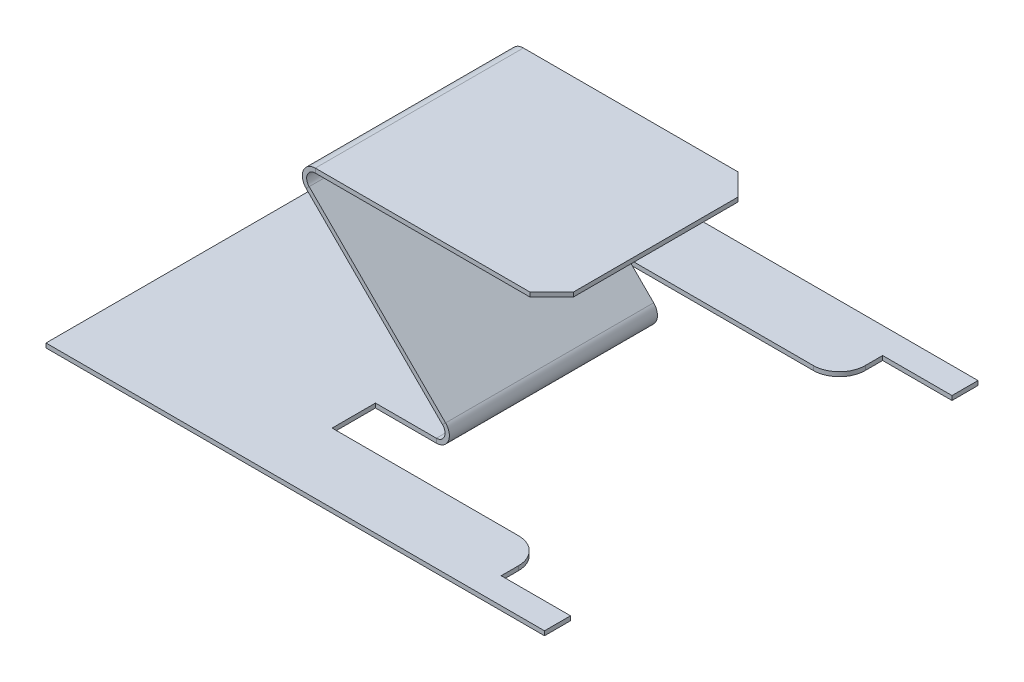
ISO-10303-21;
HEADER;
FILE_DESCRIPTION(('STEP AP214'),'2;1');
FILE_NAME('part.step','',(''),(''),'','','');
FILE_SCHEMA(('AUTOMOTIVE_DESIGN { 1 0 10303 214 1 1 1 1 }'));
ENDSEC;
DATA;
#1=APPLICATION_CONTEXT('core data for automotive mechanical design processes');
#2=APPLICATION_PROTOCOL_DEFINITION('international standard','automotive_design',2000,#1);
#3=PRODUCT_CONTEXT('',#1,'mechanical');
#4=PRODUCT('Part','Part','',(#3));
#5=PRODUCT_RELATED_PRODUCT_CATEGORY('part','',(#4));
#6=PRODUCT_DEFINITION_FORMATION('','',#4);
#7=PRODUCT_DEFINITION_CONTEXT('part definition',#1,'design');
#8=PRODUCT_DEFINITION('design','',#6,#7);
#9=PRODUCT_DEFINITION_SHAPE('','',#8);
#10=(LENGTH_UNIT() NAMED_UNIT(*) SI_UNIT(.MILLI.,.METRE.));
#11=(NAMED_UNIT(*) PLANE_ANGLE_UNIT() SI_UNIT($,.RADIAN.));
#12=(NAMED_UNIT(*) SI_UNIT($,.STERADIAN.) SOLID_ANGLE_UNIT());
#13=UNCERTAINTY_MEASURE_WITH_UNIT(LENGTH_MEASURE(1.E-05),#10,'distance_accuracy_value','');
#14=(GEOMETRIC_REPRESENTATION_CONTEXT(3) GLOBAL_UNCERTAINTY_ASSIGNED_CONTEXT((#13)) GLOBAL_UNIT_ASSIGNED_CONTEXT((#10,
#11,#12)) REPRESENTATION_CONTEXT('',''));
#15=CARTESIAN_POINT('',(0.,0.,0.));
#16=DIRECTION('',(0.,0.,1.));
#17=DIRECTION('',(1.,0.,0.));
#18=AXIS2_PLACEMENT_3D('',#15,#16,#17);
#19=CARTESIAN_POINT('',(-89.9250875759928,39.8082715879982,0.));
#20=DIRECTION('',(-0.707106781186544,-0.707106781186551,0.));
#21=DIRECTION('',(0.,0.,1.));
#22=AXIS2_PLACEMENT_3D('',#19,#20,#21);
#23=PLANE('',#22);
#24=DIRECTION('',(-0.707106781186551,0.707106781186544,0.));
#25=VECTOR('',#24,1.);
#26=CARTESIAN_POINT('',(-40.4276128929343,-9.68920309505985,24.));
#27=LINE('',#26,#25);
#28=CARTESIAN_POINT('',(-54.5310295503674,4.41421356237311,24.));
#29=VERTEX_POINT('',#28);
#30=CARTESIAN_POINT('',(-85.995495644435,35.8786796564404,24.));
#31=VERTEX_POINT('',#30);
#32=EDGE_CURVE('E426',#29,#31,#27,.T.);
#33=ORIENTED_EDGE('',*,*,#32,.T.);
#34=DIRECTION('',(0.,0.,-1.));
#35=VECTOR('',#34,1.);
#36=CARTESIAN_POINT('',(-85.995495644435,35.8786796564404,0.));
#37=LINE('',#36,#35);
#38=CARTESIAN_POINT('',(-85.995495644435,35.8786796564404,-24.));
#39=VERTEX_POINT('',#38);
#40=EDGE_CURVE('E266',#31,#39,#37,.T.);
#41=ORIENTED_EDGE('',*,*,#40,.T.);
#42=DIRECTION('',(0.707106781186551,-0.707106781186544,0.));
#43=VECTOR('',#42,1.);
#44=CARTESIAN_POINT('',(-40.4276128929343,-9.68920309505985,-24.));
#45=LINE('',#44,#43);
#46=CARTESIAN_POINT('',(-54.5310295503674,4.41421356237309,-24.));
#47=VERTEX_POINT('',#46);
#48=EDGE_CURVE('E406',#39,#47,#45,.T.);
#49=ORIENTED_EDGE('',*,*,#48,.T.);
#50=DIRECTION('',(0.,0.,-1.));
#51=VECTOR('',#50,1.);
#52=CARTESIAN_POINT('',(-54.5310295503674,4.41421356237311,0.));
#53=LINE('',#52,#51);
#54=EDGE_CURVE('E402',#29,#47,#53,.T.);
#55=ORIENTED_EDGE('',*,*,#54,.F.);
#56=EDGE_LOOP('',(#33,#41,#49,#55));
#57=FACE_BOUND('',#56,.T.);
#58=ADVANCED_FACE('F42',(#57),#23,.T.);
#59=CARTESIAN_POINT('',(-89.2179807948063,40.5153783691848,0.));
#60=DIRECTION('',(-0.707106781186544,-0.707106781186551,0.));
#61=DIRECTION('',(0.,0.,1.));
#62=AXIS2_PLACEMENT_3D('',#59,#60,#61);
#63=PLANE('',#62);
#64=DIRECTION('',(0.,0.,-1.));
#65=VECTOR('',#64,1.);
#66=CARTESIAN_POINT('',(-85.2883888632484,36.5857864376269,0.));
#67=LINE('',#66,#65);
#68=CARTESIAN_POINT('',(-85.2883888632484,36.5857864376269,24.));
#69=VERTEX_POINT('',#68);
#70=CARTESIAN_POINT('',(-85.2883888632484,36.5857864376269,-24.));
#71=VERTEX_POINT('',#70);
#72=EDGE_CURVE('E417',#69,#71,#67,.T.);
#73=ORIENTED_EDGE('',*,*,#72,.F.);
#74=DIRECTION('',(-0.707106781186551,0.707106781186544,0.));
#75=VECTOR('',#74,1.);
#76=CARTESIAN_POINT('',(-39.7205061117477,-8.9820963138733,24.));
#77=LINE('',#76,#75);
#78=CARTESIAN_POINT('',(-53.8239227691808,5.12132034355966,24.));
#79=VERTEX_POINT('',#78);
#80=EDGE_CURVE('E292',#79,#69,#77,.T.);
#81=ORIENTED_EDGE('',*,*,#80,.F.);
#82=DIRECTION('',(0.,0.,-1.));
#83=VECTOR('',#82,1.);
#84=CARTESIAN_POINT('',(-53.8239227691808,5.12132034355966,0.));
#85=LINE('',#84,#83);
#86=CARTESIAN_POINT('',(-53.8239227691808,5.12132034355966,-24.));
#87=VERTEX_POINT('',#86);
#88=EDGE_CURVE('E408',#79,#87,#85,.T.);
#89=ORIENTED_EDGE('',*,*,#88,.T.);
#90=DIRECTION('',(0.707106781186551,-0.707106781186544,0.));
#91=VECTOR('',#90,1.);
#92=CARTESIAN_POINT('',(-39.7205061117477,-8.9820963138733,-24.));
#93=LINE('',#92,#91);
#94=EDGE_CURVE('E424',#71,#87,#93,.T.);
#95=ORIENTED_EDGE('',*,*,#94,.F.);
#96=EDGE_LOOP('',(#73,#81,#89,#95));
#97=FACE_BOUND('',#96,.T.);
#98=ADVANCED_FACE('F507',(#97),#63,.F.);
#99=CARTESIAN_POINT('',(-40.4276128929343,-9.68920309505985,-24.));
#100=DIRECTION('',(0.,0.,1.));
#101=DIRECTION('',(-0.707106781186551,0.707106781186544,0.));
#102=AXIS2_PLACEMENT_3D('',#99,#100,#101);
#103=PLANE('',#102);
#104=DIRECTION('',(-0.707106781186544,-0.707106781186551,0.));
#105=VECTOR('',#104,1.);
#106=CARTESIAN_POINT('',(-85.995495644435,35.8786796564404,-24.));
#107=LINE('',#106,#105);
#108=EDGE_CURVE('E420',#71,#39,#107,.T.);
#109=ORIENTED_EDGE('',*,*,#108,.F.);
#110=ORIENTED_EDGE('',*,*,#94,.T.);
#111=DIRECTION('',(-0.707106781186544,-0.707106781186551,0.));
#112=VECTOR('',#111,1.);
#113=CARTESIAN_POINT('',(-54.5310295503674,4.41421356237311,-24.));
#114=LINE('',#113,#112);
#115=EDGE_CURVE('E405',#87,#47,#114,.T.);
#116=ORIENTED_EDGE('',*,*,#115,.T.);
#117=ORIENTED_EDGE('',*,*,#48,.F.);
#118=EDGE_LOOP('',(#109,#110,#116,#117));
#119=FACE_BOUND('',#118,.T.);
#120=ADVANCED_FACE('F510',(#119),#103,.F.);
#121=CARTESIAN_POINT('',(-40.4276128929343,-9.68920309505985,24.));
#122=DIRECTION('',(0.,0.,-1.));
#123=DIRECTION('',(0.707106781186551,-0.707106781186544,0.));
#124=AXIS2_PLACEMENT_3D('',#121,#122,#123);
#125=PLANE('',#124);
#126=DIRECTION('',(0.707106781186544,0.707106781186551,0.));
#127=VECTOR('',#126,1.);
#128=CARTESIAN_POINT('',(-85.995495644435,35.8786796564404,24.));
#129=LINE('',#128,#127);
#130=EDGE_CURVE('E415',#31,#69,#129,.T.);
#131=ORIENTED_EDGE('',*,*,#130,.F.);
#132=ORIENTED_EDGE('',*,*,#32,.F.);
#133=DIRECTION('',(0.707106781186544,0.707106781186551,0.));
#134=VECTOR('',#133,1.);
#135=CARTESIAN_POINT('',(-54.5310295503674,4.41421356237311,24.));
#136=LINE('',#135,#134);
#137=EDGE_CURVE('E411',#29,#79,#136,.T.);
#138=ORIENTED_EDGE('',*,*,#137,.T.);
#139=ORIENTED_EDGE('',*,*,#80,.T.);
#140=EDGE_LOOP('',(#131,#132,#138,#139));
#141=FACE_BOUND('',#140,.T.);
#142=ADVANCED_FACE('F498',(#141),#125,.F.);
#143=CARTESIAN_POINT('',(-70.,1.,34.));
#144=DIRECTION('',(-1.,0.,0.));
#145=DIRECTION('',(0.,0.,1.));
#146=AXIS2_PLACEMENT_3D('',#143,#144,#145);
#147=PLANE('',#146);
#148=DIRECTION('',(0.,0.,-1.));
#149=VECTOR('',#148,1.);
#150=CARTESIAN_POINT('',(-70.,0.,34.));
#151=LINE('',#150,#149);
#152=CARTESIAN_POINT('',(-70.,0.,34.));
#153=VERTEX_POINT('',#152);
#154=CARTESIAN_POINT('',(-70.,0.,24.));
#155=VERTEX_POINT('',#154);
#156=EDGE_CURVE('E392',#153,#155,#151,.T.);
#157=ORIENTED_EDGE('',*,*,#156,.T.);
#158=DIRECTION('',(0.,-1.,0.));
#159=VECTOR('',#158,1.);
#160=CARTESIAN_POINT('',(-70.,1.,24.));
#161=LINE('',#160,#159);
#162=CARTESIAN_POINT('',(-70.,1.,24.));
#163=VERTEX_POINT('',#162);
#164=EDGE_CURVE('E293',#163,#155,#161,.T.);
#165=ORIENTED_EDGE('',*,*,#164,.F.);
#166=DIRECTION('',(0.,0.,-1.));
#167=VECTOR('',#166,1.);
#168=CARTESIAN_POINT('',(-70.,1.,34.));
#169=LINE('',#168,#167);
#170=CARTESIAN_POINT('',(-70.,1.,34.));
#171=VERTEX_POINT('',#170);
#172=EDGE_CURVE('E298',#171,#163,#169,.T.);
#173=ORIENTED_EDGE('',*,*,#172,.F.);
#174=DIRECTION('',(0.,-1.,0.));
#175=VECTOR('',#174,1.);
#176=CARTESIAN_POINT('',(-70.,1.,34.));
#177=LINE('',#176,#175);
#178=EDGE_CURVE('E389',#171,#153,#177,.T.);
#179=ORIENTED_EDGE('',*,*,#178,.T.);
#180=EDGE_LOOP('',(#157,#165,#173,#179));
#181=FACE_BOUND('',#180,.T.);
#182=ADVANCED_FACE('F474',(#181),#147,.F.);
#183=CARTESIAN_POINT('',(-21.,1.,34.));
#184=DIRECTION('',(0.,0.,1.));
#185=DIRECTION('',(1.,0.,0.));
#186=AXIS2_PLACEMENT_3D('',#183,#184,#185);
#187=PLANE('',#186);
#188=DIRECTION('',(-1.,0.,0.));
#189=VECTOR('',#188,1.);
#190=CARTESIAN_POINT('',(-21.,1.,34.));
#191=LINE('',#190,#189);
#192=CARTESIAN_POINT('',(-27.,1.,34.));
#193=VERTEX_POINT('',#192);
#194=EDGE_CURVE('E300',#193,#171,#191,.T.);
#195=ORIENTED_EDGE('',*,*,#194,.F.);
#196=DIRECTION('',(0.,-1.,0.));
#197=VECTOR('',#196,1.);
#198=CARTESIAN_POINT('',(-27.,1.,34.));
#199=LINE('',#198,#197);
#200=CARTESIAN_POINT('',(-27.,0.,34.));
#201=VERTEX_POINT('',#200);
#202=EDGE_CURVE('E50',#193,#201,#199,.T.);
#203=ORIENTED_EDGE('',*,*,#202,.T.);
#204=DIRECTION('',(-1.,0.,0.));
#205=VECTOR('',#204,1.);
#206=CARTESIAN_POINT('',(-21.,0.,34.));
#207=LINE('',#206,#205);
#208=EDGE_CURVE('E387',#201,#153,#207,.T.);
#209=ORIENTED_EDGE('',*,*,#208,.T.);
#210=ORIENTED_EDGE('',*,*,#178,.F.);
#211=EDGE_LOOP('',(#195,#203,#209,#210));
#212=FACE_BOUND('',#211,.T.);
#213=ADVANCED_FACE('F462',(#212),#187,.F.);
#214=CARTESIAN_POINT('',(-21.,1.,44.));
#215=DIRECTION('',(-1.,0.,0.));
#216=DIRECTION('',(0.,0.,1.));
#217=AXIS2_PLACEMENT_3D('',#214,#215,#216);
#218=PLANE('',#217);
#219=DIRECTION('',(0.,0.,-1.));
#220=VECTOR('',#219,1.);
#221=CARTESIAN_POINT('',(-21.,0.,44.));
#222=LINE('',#221,#220);
#223=CARTESIAN_POINT('',(-21.,0.,44.));
#224=VERTEX_POINT('',#223);
#225=CARTESIAN_POINT('',(-21.,0.,40.));
#226=VERTEX_POINT('',#225);
#227=EDGE_CURVE('E385',#224,#226,#222,.T.);
#228=ORIENTED_EDGE('',*,*,#227,.T.);
#229=DIRECTION('',(0.,-1.,0.));
#230=VECTOR('',#229,1.);
#231=CARTESIAN_POINT('',(-21.,1.,40.));
#232=LINE('',#231,#230);
#233=CARTESIAN_POINT('',(-21.,1.,40.));
#234=VERTEX_POINT('',#233);
#235=EDGE_CURVE('E12',#226,#234,#232,.F.);
#236=ORIENTED_EDGE('',*,*,#235,.T.);
#237=DIRECTION('',(0.,0.,-1.));
#238=VECTOR('',#237,1.);
#239=CARTESIAN_POINT('',(-21.,1.,44.));
#240=LINE('',#239,#238);
#241=CARTESIAN_POINT('',(-21.,1.,44.));
#242=VERTEX_POINT('',#241);
#243=EDGE_CURVE('E302',#242,#234,#240,.T.);
#244=ORIENTED_EDGE('',*,*,#243,.F.);
#245=DIRECTION('',(0.,-1.,0.));
#246=VECTOR('',#245,1.);
#247=CARTESIAN_POINT('',(-21.,1.,44.));
#248=LINE('',#247,#246);
#249=EDGE_CURVE('E382',#242,#224,#248,.T.);
#250=ORIENTED_EDGE('',*,*,#249,.T.);
#251=EDGE_LOOP('',(#228,#236,#244,#250));
#252=FACE_BOUND('',#251,.T.);
#253=ADVANCED_FACE('F586',(#252),#218,.F.);
#254=CARTESIAN_POINT('',(-5.00000000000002,1.,44.));
#255=DIRECTION('',(0.,0.,1.));
#256=DIRECTION('',(1.,0.,0.));
#257=AXIS2_PLACEMENT_3D('',#254,#255,#256);
#258=PLANE('',#257);
#259=DIRECTION('',(-1.,0.,0.));
#260=VECTOR('',#259,1.);
#261=CARTESIAN_POINT('',(-5.00000000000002,0.,44.));
#262=LINE('',#261,#260);
#263=CARTESIAN_POINT('',(-5.00000000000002,0.,44.));
#264=VERTEX_POINT('',#263);
#265=EDGE_CURVE('E380',#264,#224,#262,.T.);
#266=ORIENTED_EDGE('',*,*,#265,.T.);
#267=ORIENTED_EDGE('',*,*,#249,.F.);
#268=DIRECTION('',(-1.,0.,0.));
#269=VECTOR('',#268,1.);
#270=CARTESIAN_POINT('',(-5.00000000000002,1.,44.));
#271=LINE('',#270,#269);
#272=CARTESIAN_POINT('',(-5.00000000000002,1.,44.));
#273=VERTEX_POINT('',#272);
#274=EDGE_CURVE('E304',#273,#242,#271,.T.);
#275=ORIENTED_EDGE('',*,*,#274,.F.);
#276=DIRECTION('',(0.,-1.,0.));
#277=VECTOR('',#276,1.);
#278=CARTESIAN_POINT('',(-5.00000000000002,1.,44.));
#279=LINE('',#278,#277);
#280=EDGE_CURVE('E377',#273,#264,#279,.T.);
#281=ORIENTED_EDGE('',*,*,#280,.T.);
#282=EDGE_LOOP('',(#266,#267,#275,#281));
#283=FACE_BOUND('',#282,.T.);
#284=ADVANCED_FACE('F594',(#283),#258,.F.);
#285=CARTESIAN_POINT('',(-5.00000000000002,1.,50.));
#286=DIRECTION('',(-1.,0.,0.));
#287=DIRECTION('',(0.,0.,1.));
#288=AXIS2_PLACEMENT_3D('',#285,#286,#287);
#289=PLANE('',#288);
#290=DIRECTION('',(0.,0.,-1.));
#291=VECTOR('',#290,1.);
#292=CARTESIAN_POINT('',(-5.00000000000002,0.,50.));
#293=LINE('',#292,#291);
#294=CARTESIAN_POINT('',(-5.00000000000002,0.,50.));
#295=VERTEX_POINT('',#294);
#296=EDGE_CURVE('E374',#295,#264,#293,.T.);
#297=ORIENTED_EDGE('',*,*,#296,.T.);
#298=ORIENTED_EDGE('',*,*,#280,.F.);
#299=DIRECTION('',(0.,0.,-1.));
#300=VECTOR('',#299,1.);
#301=CARTESIAN_POINT('',(-5.00000000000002,1.,50.));
#302=LINE('',#301,#300);
#303=CARTESIAN_POINT('',(-5.00000000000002,1.,50.));
#304=VERTEX_POINT('',#303);
#305=EDGE_CURVE('E306',#304,#273,#302,.T.);
#306=ORIENTED_EDGE('',*,*,#305,.F.);
#307=DIRECTION('',(0.,-1.,0.));
#308=VECTOR('',#307,1.);
#309=CARTESIAN_POINT('',(-5.00000000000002,1.,50.));
#310=LINE('',#309,#308);
#311=EDGE_CURVE('E371',#304,#295,#310,.T.);
#312=ORIENTED_EDGE('',*,*,#311,.T.);
#313=EDGE_LOOP('',(#297,#298,#306,#312));
#314=FACE_BOUND('',#313,.T.);
#315=ADVANCED_FACE('F601',(#314),#289,.F.);
#316=CARTESIAN_POINT('',(-5.00000000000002,1.,50.));
#317=DIRECTION('',(0.,0.,-1.));
#318=DIRECTION('',(-1.,0.,0.));
#319=AXIS2_PLACEMENT_3D('',#316,#317,#318);
#320=PLANE('',#319);
#321=DIRECTION('',(1.,0.,0.));
#322=VECTOR('',#321,1.);
#323=CARTESIAN_POINT('',(-5.00000000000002,0.,50.));
#324=LINE('',#323,#322);
#325=CARTESIAN_POINT('',(-120.,0.,50.));
#326=VERTEX_POINT('',#325);
#327=EDGE_CURVE('E369',#326,#295,#324,.T.);
#328=ORIENTED_EDGE('',*,*,#327,.T.);
#329=ORIENTED_EDGE('',*,*,#311,.F.);
#330=DIRECTION('',(1.,0.,0.));
#331=VECTOR('',#330,1.);
#332=CARTESIAN_POINT('',(-5.00000000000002,1.,50.));
#333=LINE('',#332,#331);
#334=CARTESIAN_POINT('',(-120.,1.,50.));
#335=VERTEX_POINT('',#334);
#336=EDGE_CURVE('E309',#335,#304,#333,.T.);
#337=ORIENTED_EDGE('',*,*,#336,.F.);
#338=DIRECTION('',(0.,-1.,0.));
#339=VECTOR('',#338,1.);
#340=CARTESIAN_POINT('',(-120.,1.,50.));
#341=LINE('',#340,#339);
#342=EDGE_CURVE('E366',#335,#326,#341,.T.);
#343=ORIENTED_EDGE('',*,*,#342,.T.);
#344=EDGE_LOOP('',(#328,#329,#337,#343));
#345=FACE_BOUND('',#344,.T.);
#346=ADVANCED_FACE('F609',(#345),#320,.F.);
#347=CARTESIAN_POINT('',(-120.,1.,50.));
#348=DIRECTION('',(1.,0.,0.));
#349=DIRECTION('',(0.,0.,-1.));
#350=AXIS2_PLACEMENT_3D('',#347,#348,#349);
#351=PLANE('',#350);
#352=DIRECTION('',(0.,0.,1.));
#353=VECTOR('',#352,1.);
#354=CARTESIAN_POINT('',(-120.,0.,50.));
#355=LINE('',#354,#353);
#356=CARTESIAN_POINT('',(-120.,0.,-50.));
#357=VERTEX_POINT('',#356);
#358=EDGE_CURVE('E364',#357,#326,#355,.T.);
#359=ORIENTED_EDGE('',*,*,#358,.T.);
#360=ORIENTED_EDGE('',*,*,#342,.F.);
#361=DIRECTION('',(0.,0.,1.));
#362=VECTOR('',#361,1.);
#363=CARTESIAN_POINT('',(-120.,1.,50.));
#364=LINE('',#363,#362);
#365=CARTESIAN_POINT('',(-120.,1.,-50.));
#366=VERTEX_POINT('',#365);
#367=EDGE_CURVE('E311',#366,#335,#364,.T.);
#368=ORIENTED_EDGE('',*,*,#367,.F.);
#369=DIRECTION('',(0.,-1.,0.));
#370=VECTOR('',#369,1.);
#371=CARTESIAN_POINT('',(-120.,1.,-50.));
#372=LINE('',#371,#370);
#373=EDGE_CURVE('E361',#366,#357,#372,.T.);
#374=ORIENTED_EDGE('',*,*,#373,.T.);
#375=EDGE_LOOP('',(#359,#360,#368,#374));
#376=FACE_BOUND('',#375,.T.);
#377=ADVANCED_FACE('F617',(#376),#351,.F.);
#378=CARTESIAN_POINT('',(-120.,1.,-50.));
#379=DIRECTION('',(0.,0.,1.));
#380=DIRECTION('',(1.,0.,0.));
#381=AXIS2_PLACEMENT_3D('',#378,#379,#380);
#382=PLANE('',#381);
#383=DIRECTION('',(-1.,0.,0.));
#384=VECTOR('',#383,1.);
#385=CARTESIAN_POINT('',(-120.,0.,-50.));
#386=LINE('',#385,#384);
#387=CARTESIAN_POINT('',(-4.99999999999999,0.,-50.));
#388=VERTEX_POINT('',#387);
#389=EDGE_CURVE('E359',#388,#357,#386,.T.);
#390=ORIENTED_EDGE('',*,*,#389,.T.);
#391=ORIENTED_EDGE('',*,*,#373,.F.);
#392=DIRECTION('',(-1.,0.,0.));
#393=VECTOR('',#392,1.);
#394=CARTESIAN_POINT('',(-120.,1.,-50.));
#395=LINE('',#394,#393);
#396=CARTESIAN_POINT('',(-4.99999999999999,1.,-50.));
#397=VERTEX_POINT('',#396);
#398=EDGE_CURVE('E313',#397,#366,#395,.T.);
#399=ORIENTED_EDGE('',*,*,#398,.F.);
#400=DIRECTION('',(0.,-1.,0.));
#401=VECTOR('',#400,1.);
#402=CARTESIAN_POINT('',(-4.99999999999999,1.,-50.));
#403=LINE('',#402,#401);
#404=EDGE_CURVE('E356',#397,#388,#403,.T.);
#405=ORIENTED_EDGE('',*,*,#404,.T.);
#406=EDGE_LOOP('',(#390,#391,#399,#405));
#407=FACE_BOUND('',#406,.T.);
#408=ADVANCED_FACE('F625',(#407),#382,.F.);
#409=CARTESIAN_POINT('',(-4.99999999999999,1.,-50.));
#410=DIRECTION('',(-1.,0.,0.));
#411=DIRECTION('',(0.,0.,1.));
#412=AXIS2_PLACEMENT_3D('',#409,#410,#411);
#413=PLANE('',#412);
#414=DIRECTION('',(0.,0.,-1.));
#415=VECTOR('',#414,1.);
#416=CARTESIAN_POINT('',(-4.99999999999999,0.,-50.));
#417=LINE('',#416,#415);
#418=CARTESIAN_POINT('',(-4.99999999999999,0.,-44.));
#419=VERTEX_POINT('',#418);
#420=EDGE_CURVE('E354',#419,#388,#417,.T.);
#421=ORIENTED_EDGE('',*,*,#420,.T.);
#422=ORIENTED_EDGE('',*,*,#404,.F.);
#423=DIRECTION('',(0.,0.,-1.));
#424=VECTOR('',#423,1.);
#425=CARTESIAN_POINT('',(-4.99999999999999,1.,-50.));
#426=LINE('',#425,#424);
#427=CARTESIAN_POINT('',(-4.99999999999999,1.,-44.));
#428=VERTEX_POINT('',#427);
#429=EDGE_CURVE('E315',#428,#397,#426,.T.);
#430=ORIENTED_EDGE('',*,*,#429,.F.);
#431=DIRECTION('',(0.,-1.,0.));
#432=VECTOR('',#431,1.);
#433=CARTESIAN_POINT('',(-4.99999999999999,1.,-44.));
#434=LINE('',#433,#432);
#435=EDGE_CURVE('E351',#428,#419,#434,.T.);
#436=ORIENTED_EDGE('',*,*,#435,.T.);
#437=EDGE_LOOP('',(#421,#422,#430,#436));
#438=FACE_BOUND('',#437,.T.);
#439=ADVANCED_FACE('F633',(#438),#413,.F.);
#440=CARTESIAN_POINT('',(-4.99999999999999,1.,-44.));
#441=DIRECTION('',(0.,0.,-1.));
#442=DIRECTION('',(-1.,0.,0.));
#443=AXIS2_PLACEMENT_3D('',#440,#441,#442);
#444=PLANE('',#443);
#445=DIRECTION('',(1.,0.,0.));
#446=VECTOR('',#445,1.);
#447=CARTESIAN_POINT('',(-4.99999999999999,0.,-44.));
#448=LINE('',#447,#446);
#449=CARTESIAN_POINT('',(-21.,0.,-44.));
#450=VERTEX_POINT('',#449);
#451=EDGE_CURVE('E349',#450,#419,#448,.T.);
#452=ORIENTED_EDGE('',*,*,#451,.T.);
#453=ORIENTED_EDGE('',*,*,#435,.F.);
#454=DIRECTION('',(1.,0.,0.));
#455=VECTOR('',#454,1.);
#456=CARTESIAN_POINT('',(-4.99999999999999,1.,-44.));
#457=LINE('',#456,#455);
#458=CARTESIAN_POINT('',(-21.,1.,-44.));
#459=VERTEX_POINT('',#458);
#460=EDGE_CURVE('E317',#459,#428,#457,.T.);
#461=ORIENTED_EDGE('',*,*,#460,.F.);
#462=DIRECTION('',(0.,-1.,0.));
#463=VECTOR('',#462,1.);
#464=CARTESIAN_POINT('',(-21.,1.,-44.));
#465=LINE('',#464,#463);
#466=EDGE_CURVE('E346',#459,#450,#465,.T.);
#467=ORIENTED_EDGE('',*,*,#466,.T.);
#468=EDGE_LOOP('',(#452,#453,#461,#467));
#469=FACE_BOUND('',#468,.T.);
#470=ADVANCED_FACE('F641',(#469),#444,.F.);
#471=CARTESIAN_POINT('',(-21.,1.,-44.));
#472=DIRECTION('',(-1.,0.,0.));
#473=DIRECTION('',(0.,0.,1.));
#474=AXIS2_PLACEMENT_3D('',#471,#472,#473);
#475=PLANE('',#474);
#476=DIRECTION('',(0.,0.,-1.));
#477=VECTOR('',#476,1.);
#478=CARTESIAN_POINT('',(-21.,1.,-44.));
#479=LINE('',#478,#477);
#480=CARTESIAN_POINT('',(-21.,1.,-40.));
#481=VERTEX_POINT('',#480);
#482=EDGE_CURVE('E319',#481,#459,#479,.T.);
#483=ORIENTED_EDGE('',*,*,#482,.F.);
#484=DIRECTION('',(0.,-1.,0.));
#485=VECTOR('',#484,1.);
#486=CARTESIAN_POINT('',(-21.,1.,-40.));
#487=LINE('',#486,#485);
#488=CARTESIAN_POINT('',(-21.,0.,-40.));
#489=VERTEX_POINT('',#488);
#490=EDGE_CURVE('E447',#481,#489,#487,.T.);
#491=ORIENTED_EDGE('',*,*,#490,.T.);
#492=DIRECTION('',(0.,0.,-1.));
#493=VECTOR('',#492,1.);
#494=CARTESIAN_POINT('',(-21.,0.,-44.));
#495=LINE('',#494,#493);
#496=EDGE_CURVE('E344',#489,#450,#495,.T.);
#497=ORIENTED_EDGE('',*,*,#496,.T.);
#498=ORIENTED_EDGE('',*,*,#466,.F.);
#499=EDGE_LOOP('',(#483,#491,#497,#498));
#500=FACE_BOUND('',#499,.T.);
#501=ADVANCED_FACE('F649',(#500),#475,.F.);
#502=CARTESIAN_POINT('',(-21.,1.,-34.));
#503=DIRECTION('',(0.,0.,-1.));
#504=DIRECTION('',(-1.,0.,0.));
#505=AXIS2_PLACEMENT_3D('',#502,#503,#504);
#506=PLANE('',#505);
#507=DIRECTION('',(1.,0.,0.));
#508=VECTOR('',#507,1.);
#509=CARTESIAN_POINT('',(-21.,0.,-34.));
#510=LINE('',#509,#508);
#511=CARTESIAN_POINT('',(-70.,0.,-34.));
#512=VERTEX_POINT('',#511);
#513=CARTESIAN_POINT('',(-27.,0.,-34.));
#514=VERTEX_POINT('',#513);
#515=EDGE_CURVE('E341',#512,#514,#510,.T.);
#516=ORIENTED_EDGE('',*,*,#515,.T.);
#517=DIRECTION('',(0.,-1.,0.));
#518=VECTOR('',#517,1.);
#519=CARTESIAN_POINT('',(-27.,1.,-34.));
#520=LINE('',#519,#518);
#521=CARTESIAN_POINT('',(-27.,1.,-34.));
#522=VERTEX_POINT('',#521);
#523=EDGE_CURVE('E454',#514,#522,#520,.F.);
#524=ORIENTED_EDGE('',*,*,#523,.T.);
#525=DIRECTION('',(1.,0.,0.));
#526=VECTOR('',#525,1.);
#527=CARTESIAN_POINT('',(-21.,1.,-34.));
#528=LINE('',#527,#526);
#529=CARTESIAN_POINT('',(-70.,1.,-34.));
#530=VERTEX_POINT('',#529);
#531=EDGE_CURVE('E321',#530,#522,#528,.T.);
#532=ORIENTED_EDGE('',*,*,#531,.F.);
#533=DIRECTION('',(0.,-1.,0.));
#534=VECTOR('',#533,1.);
#535=CARTESIAN_POINT('',(-70.,1.,-34.));
#536=LINE('',#535,#534);
#537=EDGE_CURVE('E338',#530,#512,#536,.T.);
#538=ORIENTED_EDGE('',*,*,#537,.T.);
#539=EDGE_LOOP('',(#516,#524,#532,#538));
#540=FACE_BOUND('',#539,.T.);
#541=ADVANCED_FACE('F657',(#540),#506,.F.);
#542=CARTESIAN_POINT('',(-70.,1.,-34.));
#543=DIRECTION('',(-1.,0.,0.));
#544=DIRECTION('',(0.,0.,1.));
#545=AXIS2_PLACEMENT_3D('',#542,#543,#544);
#546=PLANE('',#545);
#547=DIRECTION('',(0.,0.,-1.));
#548=VECTOR('',#547,1.);
#549=CARTESIAN_POINT('',(-70.,0.,-34.));
#550=LINE('',#549,#548);
#551=CARTESIAN_POINT('',(-70.,0.,-24.));
#552=VERTEX_POINT('',#551);
#553=EDGE_CURVE('E336',#552,#512,#550,.T.);
#554=ORIENTED_EDGE('',*,*,#553,.T.);
#555=ORIENTED_EDGE('',*,*,#537,.F.);
#556=DIRECTION('',(0.,0.,-1.));
#557=VECTOR('',#556,1.);
#558=CARTESIAN_POINT('',(-70.,1.,-34.));
#559=LINE('',#558,#557);
#560=CARTESIAN_POINT('',(-70.,1.,-24.));
#561=VERTEX_POINT('',#560);
#562=EDGE_CURVE('E324',#561,#530,#559,.T.);
#563=ORIENTED_EDGE('',*,*,#562,.F.);
#564=DIRECTION('',(0.,-1.,0.));
#565=VECTOR('',#564,1.);
#566=CARTESIAN_POINT('',(-70.,1.,-24.));
#567=LINE('',#566,#565);
#568=EDGE_CURVE('E333',#561,#552,#567,.T.);
#569=ORIENTED_EDGE('',*,*,#568,.T.);
#570=EDGE_LOOP('',(#554,#555,#563,#569));
#571=FACE_BOUND('',#570,.T.);
#572=ADVANCED_FACE('F665',(#571),#546,.F.);
#573=CARTESIAN_POINT('',(0.,1.,0.));
#574=DIRECTION('',(0.,1.,0.));
#575=DIRECTION('',(0.,0.,1.));
#576=AXIS2_PLACEMENT_3D('',#573,#574,#575);
#577=PLANE('',#576);
#578=ORIENTED_EDGE('',*,*,#531,.T.);
#579=CARTESIAN_POINT('',(-27.,1.,-40.));
#580=DIRECTION('',(0.,1.,0.));
#581=DIRECTION('',(0.,0.,1.));
#582=AXIS2_PLACEMENT_3D('',#579,#580,#581);
#583=CIRCLE('',#582,6.);
#584=EDGE_CURVE('E457',#522,#481,#583,.T.);
#585=ORIENTED_EDGE('',*,*,#584,.T.);
#586=ORIENTED_EDGE('',*,*,#482,.T.);
#587=ORIENTED_EDGE('',*,*,#460,.T.);
#588=ORIENTED_EDGE('',*,*,#429,.T.);
#589=ORIENTED_EDGE('',*,*,#398,.T.);
#590=ORIENTED_EDGE('',*,*,#367,.T.);
#591=ORIENTED_EDGE('',*,*,#336,.T.);
#592=ORIENTED_EDGE('',*,*,#305,.T.);
#593=ORIENTED_EDGE('',*,*,#274,.T.);
#594=ORIENTED_EDGE('',*,*,#243,.T.);
#595=CARTESIAN_POINT('',(-27.,1.,40.));
#596=DIRECTION('',(0.,1.,0.));
#597=DIRECTION('',(0.,0.,1.));
#598=AXIS2_PLACEMENT_3D('',#595,#596,#597);
#599=CIRCLE('',#598,6.);
#600=EDGE_CURVE('E57',#234,#193,#599,.T.);
#601=ORIENTED_EDGE('',*,*,#600,.T.);
#602=ORIENTED_EDGE('',*,*,#194,.T.);
#603=ORIENTED_EDGE('',*,*,#172,.T.);
#604=DIRECTION('',(1.,0.,0.));
#605=VECTOR('',#604,1.);
#606=CARTESIAN_POINT('',(-70.,1.,24.));
#607=LINE('',#606,#605);
#608=CARTESIAN_POINT('',(-55.9452431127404,1.,24.));
#609=VERTEX_POINT('',#608);
#610=EDGE_CURVE('E331',#163,#609,#607,.T.);
#611=ORIENTED_EDGE('',*,*,#610,.T.);
#612=DIRECTION('',(0.,0.,-1.));
#613=VECTOR('',#612,1.);
#614=CARTESIAN_POINT('',(-55.9452431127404,1.,0.));
#615=LINE('',#614,#613);
#616=CARTESIAN_POINT('',(-55.9452431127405,1.,-24.));
#617=VERTEX_POINT('',#616);
#618=EDGE_CURVE('E328',#609,#617,#615,.T.);
#619=ORIENTED_EDGE('',*,*,#618,.T.);
#620=DIRECTION('',(-1.,0.,0.));
#621=VECTOR('',#620,1.);
#622=CARTESIAN_POINT('',(-70.,1.,-24.));
#623=LINE('',#622,#621);
#624=EDGE_CURVE('E326',#617,#561,#623,.T.);
#625=ORIENTED_EDGE('',*,*,#624,.T.);
#626=ORIENTED_EDGE('',*,*,#562,.T.);
#627=EDGE_LOOP('',(#578,#585,#586,#587,#588,#589,#590,#591,#592,#593,#594,#601,#602,#603,#611,
#619,#625,#626));
#628=FACE_BOUND('',#627,.T.);
#629=ADVANCED_FACE('F481',(#628),#577,.T.);
#630=CARTESIAN_POINT('',(-70.,1.,-24.));
#631=DIRECTION('',(0.,0.,1.));
#632=DIRECTION('',(1.,0.,0.));
#633=AXIS2_PLACEMENT_3D('',#630,#631,#632);
#634=PLANE('',#633);
#635=DIRECTION('',(0.,1.,0.));
#636=VECTOR('',#635,1.);
#637=CARTESIAN_POINT('',(-55.9452431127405,1.,-24.));
#638=LINE('',#637,#636);
#639=CARTESIAN_POINT('',(-55.9452431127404,0.,-24.));
#640=VERTEX_POINT('',#639);
#641=EDGE_CURVE('E394',#640,#617,#638,.T.);
#642=ORIENTED_EDGE('',*,*,#641,.F.);
#643=DIRECTION('',(-1.,0.,0.));
#644=VECTOR('',#643,1.);
#645=CARTESIAN_POINT('',(-70.,0.,-24.));
#646=LINE('',#645,#644);
#647=EDGE_CURVE('E296',#640,#552,#646,.T.);
#648=ORIENTED_EDGE('',*,*,#647,.T.);
#649=ORIENTED_EDGE('',*,*,#568,.F.);
#650=ORIENTED_EDGE('',*,*,#624,.F.);
#651=EDGE_LOOP('',(#642,#648,#649,#650));
#652=FACE_BOUND('',#651,.T.);
#653=ADVANCED_FACE('F680',(#652),#634,.F.);
#654=CARTESIAN_POINT('',(0.,0.,0.));
#655=DIRECTION('',(0.,1.,0.));
#656=DIRECTION('',(0.,0.,1.));
#657=AXIS2_PLACEMENT_3D('',#654,#655,#656);
#658=PLANE('',#657);
#659=ORIENTED_EDGE('',*,*,#496,.F.);
#660=CARTESIAN_POINT('',(-27.,0.,-40.));
#661=DIRECTION('',(0.,1.,0.));
#662=DIRECTION('',(0.,0.,1.));
#663=AXIS2_PLACEMENT_3D('',#660,#661,#662);
#664=CIRCLE('',#663,6.);
#665=EDGE_CURVE('E452',#489,#514,#664,.F.);
#666=ORIENTED_EDGE('',*,*,#665,.T.);
#667=ORIENTED_EDGE('',*,*,#515,.F.);
#668=ORIENTED_EDGE('',*,*,#553,.F.);
#669=ORIENTED_EDGE('',*,*,#647,.F.);
#670=DIRECTION('',(0.,0.,-1.));
#671=VECTOR('',#670,1.);
#672=CARTESIAN_POINT('',(-55.9452431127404,0.,0.));
#673=LINE('',#672,#671);
#674=CARTESIAN_POINT('',(-55.9452431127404,0.,24.));
#675=VERTEX_POINT('',#674);
#676=EDGE_CURVE('E397',#675,#640,#673,.T.);
#677=ORIENTED_EDGE('',*,*,#676,.F.);
#678=DIRECTION('',(1.,0.,0.));
#679=VECTOR('',#678,1.);
#680=CARTESIAN_POINT('',(-70.,0.,24.));
#681=LINE('',#680,#679);
#682=EDGE_CURVE('E290',#155,#675,#681,.T.);
#683=ORIENTED_EDGE('',*,*,#682,.F.);
#684=ORIENTED_EDGE('',*,*,#156,.F.);
#685=ORIENTED_EDGE('',*,*,#208,.F.);
#686=CARTESIAN_POINT('',(-27.,0.,40.));
#687=DIRECTION('',(0.,1.,0.));
#688=DIRECTION('',(0.,0.,1.));
#689=AXIS2_PLACEMENT_3D('',#686,#687,#688);
#690=CIRCLE('',#689,6.);
#691=EDGE_CURVE('E450',#201,#226,#690,.F.);
#692=ORIENTED_EDGE('',*,*,#691,.T.);
#693=ORIENTED_EDGE('',*,*,#227,.F.);
#694=ORIENTED_EDGE('',*,*,#265,.F.);
#695=ORIENTED_EDGE('',*,*,#296,.F.);
#696=ORIENTED_EDGE('',*,*,#327,.F.);
#697=ORIENTED_EDGE('',*,*,#358,.F.);
#698=ORIENTED_EDGE('',*,*,#389,.F.);
#699=ORIENTED_EDGE('',*,*,#420,.F.);
#700=ORIENTED_EDGE('',*,*,#451,.F.);
#701=EDGE_LOOP('',(#659,#666,#667,#668,#669,#677,#683,#684,#685,#692,#693,#694,#695,#696,#697,
#698,#699,#700));
#702=FACE_BOUND('',#701,.T.);
#703=ADVANCED_FACE('F468',(#702),#658,.F.);
#704=CARTESIAN_POINT('',(-70.,1.,24.));
#705=DIRECTION('',(0.,0.,-1.));
#706=DIRECTION('',(-1.,0.,0.));
#707=AXIS2_PLACEMENT_3D('',#704,#705,#706);
#708=PLANE('',#707);
#709=DIRECTION('',(0.,-1.,0.));
#710=VECTOR('',#709,1.);
#711=CARTESIAN_POINT('',(-55.9452431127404,1.,24.));
#712=LINE('',#711,#710);
#713=EDGE_CURVE('E285',#609,#675,#712,.T.);
#714=ORIENTED_EDGE('',*,*,#713,.F.);
#715=ORIENTED_EDGE('',*,*,#610,.F.);
#716=ORIENTED_EDGE('',*,*,#164,.T.);
#717=ORIENTED_EDGE('',*,*,#682,.T.);
#718=EDGE_LOOP('',(#714,#715,#716,#717));
#719=FACE_BOUND('',#718,.T.);
#720=ADVANCED_FACE('F479',(#719),#708,.F.);
#721=CARTESIAN_POINT('',(-55.9452431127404,3.,24.));
#722=DIRECTION('',(0.,0.,-1.));
#723=DIRECTION('',(-1.,0.,0.));
#724=AXIS2_PLACEMENT_3D('',#721,#722,#723);
#725=PLANE('',#724);
#726=ORIENTED_EDGE('',*,*,#713,.T.);
#727=CARTESIAN_POINT('',(-55.9452431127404,3.,24.));
#728=DIRECTION('',(0.,0.,-1.));
#729=DIRECTION('',(-1.,0.,0.));
#730=AXIS2_PLACEMENT_3D('',#727,#728,#729);
#731=CIRCLE('',#730,3.);
#732=EDGE_CURVE('E270',#675,#79,#731,.F.);
#733=ORIENTED_EDGE('',*,*,#732,.T.);
#734=ORIENTED_EDGE('',*,*,#137,.F.);
#735=CARTESIAN_POINT('',(-55.9452431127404,3.,24.));
#736=DIRECTION('',(0.,0.,1.));
#737=DIRECTION('',(1.,0.,0.));
#738=AXIS2_PLACEMENT_3D('',#735,#736,#737);
#739=CIRCLE('',#738,2.);
#740=EDGE_CURVE('E278',#609,#29,#739,.T.);
#741=ORIENTED_EDGE('',*,*,#740,.F.);
#742=EDGE_LOOP('',(#726,#733,#734,#741));
#743=FACE_BOUND('',#742,.T.);
#744=ADVANCED_FACE('F501',(#743),#725,.F.);
#745=CARTESIAN_POINT('',(-55.9452431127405,3.,-24.));
#746=DIRECTION('',(0.,0.,1.));
#747=DIRECTION('',(1.,0.,0.));
#748=AXIS2_PLACEMENT_3D('',#745,#746,#747);
#749=PLANE('',#748);
#750=CARTESIAN_POINT('',(-55.9452431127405,3.,-24.));
#751=DIRECTION('',(0.,0.,-1.));
#752=DIRECTION('',(-1.,0.,0.));
#753=AXIS2_PLACEMENT_3D('',#750,#751,#752);
#754=CIRCLE('',#753,3.);
#755=EDGE_CURVE('E282',#87,#640,#754,.T.);
#756=ORIENTED_EDGE('',*,*,#755,.T.);
#757=ORIENTED_EDGE('',*,*,#641,.T.);
#758=CARTESIAN_POINT('',(-55.9452431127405,3.,-24.));
#759=DIRECTION('',(0.,0.,-1.));
#760=DIRECTION('',(-1.,0.,0.));
#761=AXIS2_PLACEMENT_3D('',#758,#759,#760);
#762=CIRCLE('',#761,2.);
#763=EDGE_CURVE('E281',#47,#617,#762,.T.);
#764=ORIENTED_EDGE('',*,*,#763,.F.);
#765=ORIENTED_EDGE('',*,*,#115,.F.);
#766=EDGE_LOOP('',(#756,#757,#764,#765));
#767=FACE_BOUND('',#766,.T.);
#768=ADVANCED_FACE('F488',(#767),#749,.F.);
#769=CARTESIAN_POINT('',(-55.9452431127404,3.,48.3704230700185));
#770=DIRECTION('',(0.,0.,-1.));
#771=DIRECTION('',(-1.,0.,0.));
#772=AXIS2_PLACEMENT_3D('',#769,#770,#771);
#773=CYLINDRICAL_SURFACE('',#772,2.);
#774=ORIENTED_EDGE('',*,*,#54,.T.);
#775=ORIENTED_EDGE('',*,*,#763,.T.);
#776=ORIENTED_EDGE('',*,*,#618,.F.);
#777=ORIENTED_EDGE('',*,*,#740,.T.);
#778=EDGE_LOOP('',(#774,#775,#776,#777));
#779=FACE_BOUND('',#778,.T.);
#780=ADVANCED_FACE('F492',(#779),#773,.F.);
#781=CARTESIAN_POINT('',(-55.9452431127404,3.,48.3704230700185));
#782=DIRECTION('',(0.,0.,-1.));
#783=DIRECTION('',(-1.,0.,0.));
#784=AXIS2_PLACEMENT_3D('',#781,#782,#783);
#785=CYLINDRICAL_SURFACE('',#784,3.);
#786=ORIENTED_EDGE('',*,*,#88,.F.);
#787=ORIENTED_EDGE('',*,*,#732,.F.);
#788=ORIENTED_EDGE('',*,*,#676,.T.);
#789=ORIENTED_EDGE('',*,*,#755,.F.);
#790=EDGE_LOOP('',(#786,#787,#788,#789));
#791=FACE_BOUND('',#790,.T.);
#792=ADVANCED_FACE('F504',(#791),#785,.T.);
#793=CARTESIAN_POINT('',(-83.8741753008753,38.,24.));
#794=DIRECTION('',(0.,0.,1.));
#795=DIRECTION('',(1.,0.,0.));
#796=AXIS2_PLACEMENT_3D('',#793,#794,#795);
#797=PLANE('',#796);
#798=ORIENTED_EDGE('',*,*,#130,.T.);
#799=CARTESIAN_POINT('',(-83.8741753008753,38.,24.));
#800=DIRECTION('',(0.,0.,-1.));
#801=DIRECTION('',(-1.,0.,0.));
#802=AXIS2_PLACEMENT_3D('',#799,#800,#801);
#803=CIRCLE('',#802,2.);
#804=CARTESIAN_POINT('',(-83.8741753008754,40.,24.));
#805=VERTEX_POINT('',#804);
#806=EDGE_CURVE('E260',#69,#805,#803,.T.);
#807=ORIENTED_EDGE('',*,*,#806,.T.);
#808=DIRECTION('',(0.,-1.,0.));
#809=VECTOR('',#808,1.);
#810=CARTESIAN_POINT('',(-83.8741753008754,41.,24.));
#811=LINE('',#810,#809);
#812=CARTESIAN_POINT('',(-83.8741753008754,41.,24.));
#813=VERTEX_POINT('',#812);
#814=EDGE_CURVE('E247',#813,#805,#811,.T.);
#815=ORIENTED_EDGE('',*,*,#814,.F.);
#816=CARTESIAN_POINT('',(-83.8741753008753,38.,24.));
#817=DIRECTION('',(0.,0.,-1.));
#818=DIRECTION('',(-1.,0.,0.));
#819=AXIS2_PLACEMENT_3D('',#816,#817,#818);
#820=CIRCLE('',#819,3.);
#821=EDGE_CURVE('E258',#31,#813,#820,.T.);
#822=ORIENTED_EDGE('',*,*,#821,.F.);
#823=EDGE_LOOP('',(#798,#807,#815,#822));
#824=FACE_BOUND('',#823,.T.);
#825=ADVANCED_FACE('F257',(#824),#797,.T.);
#826=CARTESIAN_POINT('',(-83.8741753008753,38.,-24.));
#827=DIRECTION('',(0.,0.,-1.));
#828=DIRECTION('',(-1.,0.,0.));
#829=AXIS2_PLACEMENT_3D('',#826,#827,#828);
#830=PLANE('',#829);
#831=CARTESIAN_POINT('',(-83.8741753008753,38.,-24.));
#832=DIRECTION('',(0.,0.,-1.));
#833=DIRECTION('',(-1.,0.,0.));
#834=AXIS2_PLACEMENT_3D('',#831,#832,#833);
#835=CIRCLE('',#834,2.);
#836=CARTESIAN_POINT('',(-83.8741753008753,40.,-24.));
#837=VERTEX_POINT('',#836);
#838=EDGE_CURVE('E268',#837,#71,#835,.F.);
#839=ORIENTED_EDGE('',*,*,#838,.T.);
#840=ORIENTED_EDGE('',*,*,#108,.T.);
#841=CARTESIAN_POINT('',(-83.8741753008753,38.,-24.));
#842=DIRECTION('',(0.,0.,1.));
#843=DIRECTION('',(1.,0.,0.));
#844=AXIS2_PLACEMENT_3D('',#841,#842,#843);
#845=CIRCLE('',#844,3.);
#846=CARTESIAN_POINT('',(-83.8741753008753,41.,-24.));
#847=VERTEX_POINT('',#846);
#848=EDGE_CURVE('E267',#847,#39,#845,.T.);
#849=ORIENTED_EDGE('',*,*,#848,.F.);
#850=DIRECTION('',(0.,1.,0.));
#851=VECTOR('',#850,1.);
#852=CARTESIAN_POINT('',(-83.8741753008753,41.,-24.));
#853=LINE('',#852,#851);
#854=EDGE_CURVE('E276',#837,#847,#853,.T.);
#855=ORIENTED_EDGE('',*,*,#854,.F.);
#856=EDGE_LOOP('',(#839,#840,#849,#855));
#857=FACE_BOUND('',#856,.T.);
#858=ADVANCED_FACE('F516',(#857),#830,.T.);
#859=CARTESIAN_POINT('',(-83.8741753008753,38.,48.4920488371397));
#860=DIRECTION('',(0.,0.,-1.));
#861=DIRECTION('',(-1.,0.,0.));
#862=AXIS2_PLACEMENT_3D('',#859,#860,#861);
#863=CYLINDRICAL_SURFACE('',#862,3.);
#864=DIRECTION('',(0.,0.,-1.));
#865=VECTOR('',#864,1.);
#866=CARTESIAN_POINT('',(-83.8741753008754,41.,0.));
#867=LINE('',#866,#865);
#868=EDGE_CURVE('E227',#813,#847,#867,.T.);
#869=ORIENTED_EDGE('',*,*,#868,.T.);
#870=ORIENTED_EDGE('',*,*,#848,.T.);
#871=ORIENTED_EDGE('',*,*,#40,.F.);
#872=ORIENTED_EDGE('',*,*,#821,.T.);
#873=EDGE_LOOP('',(#869,#870,#871,#872));
#874=FACE_BOUND('',#873,.T.);
#875=ADVANCED_FACE('F264',(#874),#863,.T.);
#876=CARTESIAN_POINT('',(-83.8741753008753,38.,48.4920488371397));
#877=DIRECTION('',(0.,0.,-1.));
#878=DIRECTION('',(-1.,0.,0.));
#879=AXIS2_PLACEMENT_3D('',#876,#877,#878);
#880=CYLINDRICAL_SURFACE('',#879,2.);
#881=DIRECTION('',(0.,0.,-1.));
#882=VECTOR('',#881,1.);
#883=CARTESIAN_POINT('',(-83.8741753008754,40.,0.));
#884=LINE('',#883,#882);
#885=EDGE_CURVE('E520',#805,#837,#884,.T.);
#886=ORIENTED_EDGE('',*,*,#885,.F.);
#887=ORIENTED_EDGE('',*,*,#806,.F.);
#888=ORIENTED_EDGE('',*,*,#72,.T.);
#889=ORIENTED_EDGE('',*,*,#838,.F.);
#890=EDGE_LOOP('',(#886,#887,#888,#889));
#891=FACE_BOUND('',#890,.T.);
#892=ADVANCED_FACE('F514',(#891),#880,.F.);
#893=CARTESIAN_POINT('',(-29.343145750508,41.,24.));
#894=DIRECTION('',(-1.,0.,0.));
#895=DIRECTION('',(0.,0.,1.));
#896=AXIS2_PLACEMENT_3D('',#893,#894,#895);
#897=PLANE('',#896);
#898=DIRECTION('',(0.,0.,-1.));
#899=VECTOR('',#898,1.);
#900=CARTESIAN_POINT('',(-29.343145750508,40.,24.));
#901=LINE('',#900,#899);
#902=CARTESIAN_POINT('',(-29.343145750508,40.,19.));
#903=VERTEX_POINT('',#902);
#904=CARTESIAN_POINT('',(-29.343145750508,40.,-19.));
#905=VERTEX_POINT('',#904);
#906=EDGE_CURVE('E240',#903,#905,#901,.T.);
#907=ORIENTED_EDGE('',*,*,#906,.T.);
#908=DIRECTION('',(0.,1.,0.));
#909=VECTOR('',#908,1.);
#910=CARTESIAN_POINT('',(-29.343145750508,41.,-19.));
#911=LINE('',#910,#909);
#912=CARTESIAN_POINT('',(-29.343145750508,41.,-19.));
#913=VERTEX_POINT('',#912);
#914=EDGE_CURVE('E443',#905,#913,#911,.T.);
#915=ORIENTED_EDGE('',*,*,#914,.T.);
#916=DIRECTION('',(0.,0.,-1.));
#917=VECTOR('',#916,1.);
#918=CARTESIAN_POINT('',(-29.343145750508,41.,24.));
#919=LINE('',#918,#917);
#920=CARTESIAN_POINT('',(-29.343145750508,41.,19.));
#921=VERTEX_POINT('',#920);
#922=EDGE_CURVE('E251',#921,#913,#919,.T.);
#923=ORIENTED_EDGE('',*,*,#922,.F.);
#924=DIRECTION('',(0.,-1.,0.));
#925=VECTOR('',#924,1.);
#926=CARTESIAN_POINT('',(-29.343145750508,41.,19.));
#927=LINE('',#926,#925);
#928=EDGE_CURVE('E423',#921,#903,#927,.T.);
#929=ORIENTED_EDGE('',*,*,#928,.T.);
#930=EDGE_LOOP('',(#907,#915,#923,#929));
#931=FACE_BOUND('',#930,.T.);
#932=ADVANCED_FACE('F531',(#931),#897,.F.);
#933=CARTESIAN_POINT('',(-84.2073793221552,41.,0.));
#934=DIRECTION('',(0.,1.,0.));
#935=DIRECTION('',(0.,0.,1.));
#936=AXIS2_PLACEMENT_3D('',#933,#934,#935);
#937=PLANE('',#936);
#938=ORIENTED_EDGE('',*,*,#922,.T.);
#939=DIRECTION('',(0.707106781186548,0.,0.707106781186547));
#940=VECTOR('',#939,1.);
#941=CARTESIAN_POINT('',(-47.2752625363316,41.,-36.9321167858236));
#942=LINE('',#941,#940);
#943=CARTESIAN_POINT('',(-34.343145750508,41.,-24.));
#944=VERTEX_POINT('',#943);
#945=EDGE_CURVE('E445',#913,#944,#942,.F.);
#946=ORIENTED_EDGE('',*,*,#945,.T.);
#947=DIRECTION('',(-1.,0.,0.));
#948=VECTOR('',#947,1.);
#949=CARTESIAN_POINT('',(-154.207379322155,41.,-24.));
#950=LINE('',#949,#948);
#951=EDGE_CURVE('E234',#944,#847,#950,.T.);
#952=ORIENTED_EDGE('',*,*,#951,.T.);
#953=ORIENTED_EDGE('',*,*,#868,.F.);
#954=DIRECTION('',(1.,0.,0.));
#955=VECTOR('',#954,1.);
#956=CARTESIAN_POINT('',(-154.207379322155,41.,24.));
#957=LINE('',#956,#955);
#958=CARTESIAN_POINT('',(-34.343145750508,41.,24.));
#959=VERTEX_POINT('',#958);
#960=EDGE_CURVE('E231',#813,#959,#957,.T.);
#961=ORIENTED_EDGE('',*,*,#960,.T.);
#962=DIRECTION('',(-0.707106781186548,0.,0.707106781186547));
#963=VECTOR('',#962,1.);
#964=CARTESIAN_POINT('',(-47.2752625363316,41.,36.9321167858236));
#965=LINE('',#964,#963);
#966=EDGE_CURVE('E436',#959,#921,#965,.F.);
#967=ORIENTED_EDGE('',*,*,#966,.T.);
#968=EDGE_LOOP('',(#938,#946,#952,#953,#961,#967));
#969=FACE_BOUND('',#968,.T.);
#970=ADVANCED_FACE('F230',(#969),#937,.T.);
#971=CARTESIAN_POINT('',(-154.207379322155,41.,24.));
#972=DIRECTION('',(0.,0.,-1.));
#973=DIRECTION('',(-1.,0.,0.));
#974=AXIS2_PLACEMENT_3D('',#971,#972,#973);
#975=PLANE('',#974);
#976=DIRECTION('',(1.,0.,0.));
#977=VECTOR('',#976,1.);
#978=CARTESIAN_POINT('',(-154.207379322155,40.,24.));
#979=LINE('',#978,#977);
#980=CARTESIAN_POINT('',(-34.343145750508,40.,24.));
#981=VERTEX_POINT('',#980);
#982=EDGE_CURVE('E261',#805,#981,#979,.T.);
#983=ORIENTED_EDGE('',*,*,#982,.T.);
#984=DIRECTION('',(0.,1.,0.));
#985=VECTOR('',#984,1.);
#986=CARTESIAN_POINT('',(-34.343145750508,41.,24.));
#987=LINE('',#986,#985);
#988=EDGE_CURVE('E250',#981,#959,#987,.T.);
#989=ORIENTED_EDGE('',*,*,#988,.T.);
#990=ORIENTED_EDGE('',*,*,#960,.F.);
#991=ORIENTED_EDGE('',*,*,#814,.T.);
#992=EDGE_LOOP('',(#983,#989,#990,#991));
#993=FACE_BOUND('',#992,.T.);
#994=ADVANCED_FACE('F246',(#993),#975,.F.);
#995=CARTESIAN_POINT('',(-84.2073793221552,40.,0.));
#996=DIRECTION('',(0.,1.,0.));
#997=DIRECTION('',(0.,0.,1.));
#998=AXIS2_PLACEMENT_3D('',#995,#996,#997);
#999=PLANE('',#998);
#1000=DIRECTION('',(-1.,0.,0.));
#1001=VECTOR('',#1000,1.);
#1002=CARTESIAN_POINT('',(-154.207379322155,40.,-24.));
#1003=LINE('',#1002,#1001);
#1004=CARTESIAN_POINT('',(-34.343145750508,40.,-24.));
#1005=VERTEX_POINT('',#1004);
#1006=EDGE_CURVE('E518',#1005,#837,#1003,.T.);
#1007=ORIENTED_EDGE('',*,*,#1006,.F.);
#1008=DIRECTION('',(-0.707106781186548,0.,-0.707106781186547));
#1009=VECTOR('',#1008,1.);
#1010=CARTESIAN_POINT('',(-34.343145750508,40.,-24.));
#1011=LINE('',#1010,#1009);
#1012=EDGE_CURVE('E441',#1005,#905,#1011,.F.);
#1013=ORIENTED_EDGE('',*,*,#1012,.T.);
#1014=ORIENTED_EDGE('',*,*,#906,.F.);
#1015=DIRECTION('',(0.707106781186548,0.,-0.707106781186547));
#1016=VECTOR('',#1015,1.);
#1017=CARTESIAN_POINT('',(-29.343145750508,40.,19.));
#1018=LINE('',#1017,#1016);
#1019=EDGE_CURVE('E433',#903,#981,#1018,.F.);
#1020=ORIENTED_EDGE('',*,*,#1019,.T.);
#1021=ORIENTED_EDGE('',*,*,#982,.F.);
#1022=ORIENTED_EDGE('',*,*,#885,.T.);
#1023=EDGE_LOOP('',(#1007,#1013,#1014,#1020,#1021,#1022));
#1024=FACE_BOUND('',#1023,.T.);
#1025=ADVANCED_FACE('F541',(#1024),#999,.F.);
#1026=CARTESIAN_POINT('',(-154.207379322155,41.,-24.));
#1027=DIRECTION('',(0.,0.,1.));
#1028=DIRECTION('',(1.,0.,0.));
#1029=AXIS2_PLACEMENT_3D('',#1026,#1027,#1028);
#1030=PLANE('',#1029);
#1031=ORIENTED_EDGE('',*,*,#951,.F.);
#1032=DIRECTION('',(0.,-1.,0.));
#1033=VECTOR('',#1032,1.);
#1034=CARTESIAN_POINT('',(-34.343145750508,41.,-24.));
#1035=LINE('',#1034,#1033);
#1036=EDGE_CURVE('E438',#944,#1005,#1035,.T.);
#1037=ORIENTED_EDGE('',*,*,#1036,.T.);
#1038=ORIENTED_EDGE('',*,*,#1006,.T.);
#1039=ORIENTED_EDGE('',*,*,#854,.T.);
#1040=EDGE_LOOP('',(#1031,#1037,#1038,#1039));
#1041=FACE_BOUND('',#1040,.T.);
#1042=ADVANCED_FACE('F539',(#1041),#1030,.F.);
#1043=CARTESIAN_POINT('',(-29.343145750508,41.,19.));
#1044=DIRECTION('',(-0.707106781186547,0.,-0.707106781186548));
#1045=DIRECTION('',(0.,-1.,0.));
#1046=AXIS2_PLACEMENT_3D('',#1043,#1044,#1045);
#1047=PLANE('',#1046);
#1048=ORIENTED_EDGE('',*,*,#966,.F.);
#1049=ORIENTED_EDGE('',*,*,#988,.F.);
#1050=ORIENTED_EDGE('',*,*,#1019,.F.);
#1051=ORIENTED_EDGE('',*,*,#928,.F.);
#1052=EDGE_LOOP('',(#1048,#1049,#1050,#1051));
#1053=FACE_BOUND('',#1052,.T.);
#1054=ADVANCED_FACE('F543',(#1053),#1047,.F.);
#1055=CARTESIAN_POINT('',(-34.343145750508,41.,-24.));
#1056=DIRECTION('',(-0.707106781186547,0.,0.707106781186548));
#1057=DIRECTION('',(0.,-1.,0.));
#1058=AXIS2_PLACEMENT_3D('',#1055,#1056,#1057);
#1059=PLANE('',#1058);
#1060=ORIENTED_EDGE('',*,*,#945,.F.);
#1061=ORIENTED_EDGE('',*,*,#914,.F.);
#1062=ORIENTED_EDGE('',*,*,#1012,.F.);
#1063=ORIENTED_EDGE('',*,*,#1036,.F.);
#1064=EDGE_LOOP('',(#1060,#1061,#1062,#1063));
#1065=FACE_BOUND('',#1064,.T.);
#1066=ADVANCED_FACE('F537',(#1065),#1059,.F.);
#1067=CARTESIAN_POINT('',(-27.,1.,-40.));
#1068=DIRECTION('',(0.,-1.,0.));
#1069=DIRECTION('',(0.,0.,-1.));
#1070=AXIS2_PLACEMENT_3D('',#1067,#1068,#1069);
#1071=CYLINDRICAL_SURFACE('',#1070,6.);
#1072=ORIENTED_EDGE('',*,*,#584,.F.);
#1073=ORIENTED_EDGE('',*,*,#523,.F.);
#1074=ORIENTED_EDGE('',*,*,#665,.F.);
#1075=ORIENTED_EDGE('',*,*,#490,.F.);
#1076=EDGE_LOOP('',(#1072,#1073,#1074,#1075));
#1077=FACE_BOUND('',#1076,.T.);
#1078=ADVANCED_FACE('F550',(#1077),#1071,.T.);
#1079=CARTESIAN_POINT('',(-27.,1.,40.));
#1080=DIRECTION('',(0.,-1.,0.));
#1081=DIRECTION('',(0.,0.,-1.));
#1082=AXIS2_PLACEMENT_3D('',#1079,#1080,#1081);
#1083=CYLINDRICAL_SURFACE('',#1082,6.);
#1084=ORIENTED_EDGE('',*,*,#600,.F.);
#1085=ORIENTED_EDGE('',*,*,#235,.F.);
#1086=ORIENTED_EDGE('',*,*,#691,.F.);
#1087=ORIENTED_EDGE('',*,*,#202,.F.);
#1088=EDGE_LOOP('',(#1084,#1085,#1086,#1087));
#1089=FACE_BOUND('',#1088,.T.);
#1090=ADVANCED_FACE('F44',(#1089),#1083,.T.);
#1091=CLOSED_SHELL('',(#58,#98,#120,#142,#182,#213,#253,#284,#315,#346,#377,#408,#439,#470,#501,
#541,#572,#629,#653,#703,#720,#744,#768,#780,#792,#825,#858,#875,#892,#932,#970,#994,#1025,
#1042,#1054,#1066,#1078,#1090));
#1092=MANIFOLD_SOLID_BREP('B2',#1091);
#1093=ADVANCED_BREP_SHAPE_REPRESENTATION('',(#18,#1092),#14);
#1094=SHAPE_DEFINITION_REPRESENTATION(#9,#1093);
ENDSEC;
END-ISO-10303-21;
